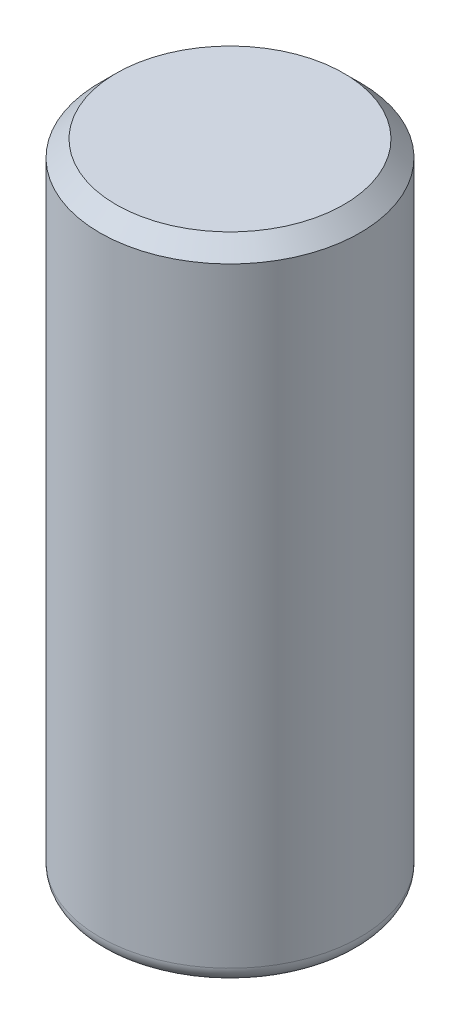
ISO-10303-21;
HEADER;
FILE_DESCRIPTION(('STEP AP214'),'2;1');
FILE_NAME('part.step','',(''),(''),'','','');
FILE_SCHEMA(('AUTOMOTIVE_DESIGN { 1 0 10303 214 1 1 1 1 }'));
ENDSEC;
DATA;
#1=APPLICATION_CONTEXT('core data for automotive mechanical design processes');
#2=APPLICATION_PROTOCOL_DEFINITION('international standard','automotive_design',2000,#1);
#3=PRODUCT_CONTEXT('',#1,'mechanical');
#4=PRODUCT('Part','Part','',(#3));
#5=PRODUCT_RELATED_PRODUCT_CATEGORY('part','',(#4));
#6=PRODUCT_DEFINITION_FORMATION('','',#4);
#7=PRODUCT_DEFINITION_CONTEXT('part definition',#1,'design');
#8=PRODUCT_DEFINITION('design','',#6,#7);
#9=PRODUCT_DEFINITION_SHAPE('','',#8);
#10=(LENGTH_UNIT() NAMED_UNIT(*) SI_UNIT(.MILLI.,.METRE.));
#11=(NAMED_UNIT(*) PLANE_ANGLE_UNIT() SI_UNIT($,.RADIAN.));
#12=(NAMED_UNIT(*) SI_UNIT($,.STERADIAN.) SOLID_ANGLE_UNIT());
#13=UNCERTAINTY_MEASURE_WITH_UNIT(LENGTH_MEASURE(1.E-05),#10,'distance_accuracy_value','');
#14=(GEOMETRIC_REPRESENTATION_CONTEXT(3) GLOBAL_UNCERTAINTY_ASSIGNED_CONTEXT((#13)) GLOBAL_UNIT_ASSIGNED_CONTEXT((#10,
#11,#12)) REPRESENTATION_CONTEXT('',''));
#15=CARTESIAN_POINT('',(0.,0.,0.));
#16=DIRECTION('',(0.,0.,1.));
#17=DIRECTION('',(1.,0.,0.));
#18=AXIS2_PLACEMENT_3D('',#15,#16,#17);
#19=CARTESIAN_POINT('',(0.,0.,0.));
#20=DIRECTION('',(0.,-1.,0.));
#21=DIRECTION('',(0.,0.,-1.));
#22=AXIS2_PLACEMENT_3D('',#19,#20,#21);
#23=PLANE('',#22);
#24=CARTESIAN_POINT('',(0.,0.,0.));
#25=DIRECTION('',(0.,-1.,0.));
#26=DIRECTION('',(0.,0.,-1.));
#27=AXIS2_PLACEMENT_3D('',#24,#25,#26);
#28=CIRCLE('',#27,1.778);
#29=CARTESIAN_POINT('',(0.,0.,-1.778));
#30=VERTEX_POINT('',#29);
#31=EDGE_CURVE('E41',#30,#30,#28,.T.);
#32=ORIENTED_EDGE('',*,*,#31,.T.);
#33=EDGE_LOOP('',(#32));
#34=FACE_BOUND('',#33,.T.);
#35=ADVANCED_FACE('F30',(#34),#23,.T.);
#36=CARTESIAN_POINT('',(0.,7.98295478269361,0.));
#37=DIRECTION('',(0.,1.,0.));
#38=DIRECTION('',(0.,0.,1.));
#39=AXIS2_PLACEMENT_3D('',#36,#37,#38);
#40=CYLINDRICAL_SURFACE('',#39,2.032);
#41=CARTESIAN_POINT('',(0.,9.779,0.));
#42=DIRECTION('',(0.,1.,0.));
#43=DIRECTION('',(0.,0.,1.));
#44=AXIS2_PLACEMENT_3D('',#41,#42,#43);
#45=CIRCLE('',#44,2.032);
#46=CARTESIAN_POINT('',(0.,9.779,2.032));
#47=VERTEX_POINT('',#46);
#48=EDGE_CURVE('E10',#47,#47,#45,.F.);
#49=ORIENTED_EDGE('',*,*,#48,.T.);
#50=EDGE_LOOP('',(#49));
#51=FACE_BOUND('',#50,.T.);
#52=CARTESIAN_POINT('',(0.,0.254,0.));
#53=DIRECTION('',(0.,-1.,0.));
#54=DIRECTION('',(0.,0.,-1.));
#55=AXIS2_PLACEMENT_3D('',#52,#53,#54);
#56=CIRCLE('',#55,2.032);
#57=CARTESIAN_POINT('',(0.,0.254,-2.032));
#58=VERTEX_POINT('',#57);
#59=EDGE_CURVE('E45',#58,#58,#56,.F.);
#60=ORIENTED_EDGE('',*,*,#59,.T.);
#61=EDGE_LOOP('',(#60));
#62=FACE_BOUND('',#61,.T.);
#63=ADVANCED_FACE('F51',(#51,#62),#40,.T.);
#64=CARTESIAN_POINT('',(-2.032,10.033,0.));
#65=DIRECTION('',(0.,1.,0.));
#66=DIRECTION('',(0.,0.,1.));
#67=AXIS2_PLACEMENT_3D('',#64,#65,#66);
#68=PLANE('',#67);
#69=CARTESIAN_POINT('',(0.,10.033,0.));
#70=DIRECTION('',(0.,1.,0.));
#71=DIRECTION('',(0.,0.,1.));
#72=AXIS2_PLACEMENT_3D('',#69,#70,#71);
#73=CIRCLE('',#72,1.778);
#74=CARTESIAN_POINT('',(0.,10.033,1.778));
#75=VERTEX_POINT('',#74);
#76=EDGE_CURVE('E37',#75,#75,#73,.T.);
#77=ORIENTED_EDGE('',*,*,#76,.T.);
#78=EDGE_LOOP('',(#77));
#79=FACE_BOUND('',#78,.T.);
#80=ADVANCED_FACE('F55',(#79),#68,.T.);
#81=CARTESIAN_POINT('',(0.,0.254,0.));
#82=DIRECTION('',(0.,-1.,0.));
#83=DIRECTION('',(0.,0.,-1.));
#84=AXIS2_PLACEMENT_3D('',#81,#82,#83);
#85=TOROIDAL_SURFACE('',#84,1.778,0.254);
#86=ORIENTED_EDGE('',*,*,#31,.F.);
#87=EDGE_LOOP('',(#86));
#88=FACE_BOUND('',#87,.T.);
#89=ORIENTED_EDGE('',*,*,#59,.F.);
#90=EDGE_LOOP('',(#89));
#91=FACE_BOUND('',#90,.T.);
#92=ADVANCED_FACE('F53',(#88,#91),#85,.T.);
#93=CARTESIAN_POINT('',(0.,10.033,0.));
#94=DIRECTION('',(0.,-1.,0.));
#95=DIRECTION('',(0.,0.,-1.));
#96=AXIS2_PLACEMENT_3D('',#93,#94,#95);
#97=CONICAL_SURFACE('',#96,1.778,0.785398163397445);
#98=ORIENTED_EDGE('',*,*,#48,.F.);
#99=EDGE_LOOP('',(#98));
#100=FACE_BOUND('',#99,.T.);
#101=ORIENTED_EDGE('',*,*,#76,.F.);
#102=EDGE_LOOP('',(#101));
#103=FACE_BOUND('',#102,.T.);
#104=ADVANCED_FACE('F32',(#100,#103),#97,.T.);
#105=CLOSED_SHELL('',(#35,#63,#80,#92,#104));
#106=MANIFOLD_SOLID_BREP('B2',#105);
#107=ADVANCED_BREP_SHAPE_REPRESENTATION('',(#18,#106),#14);
#108=SHAPE_DEFINITION_REPRESENTATION(#9,#107);
ENDSEC;
END-ISO-10303-21;
